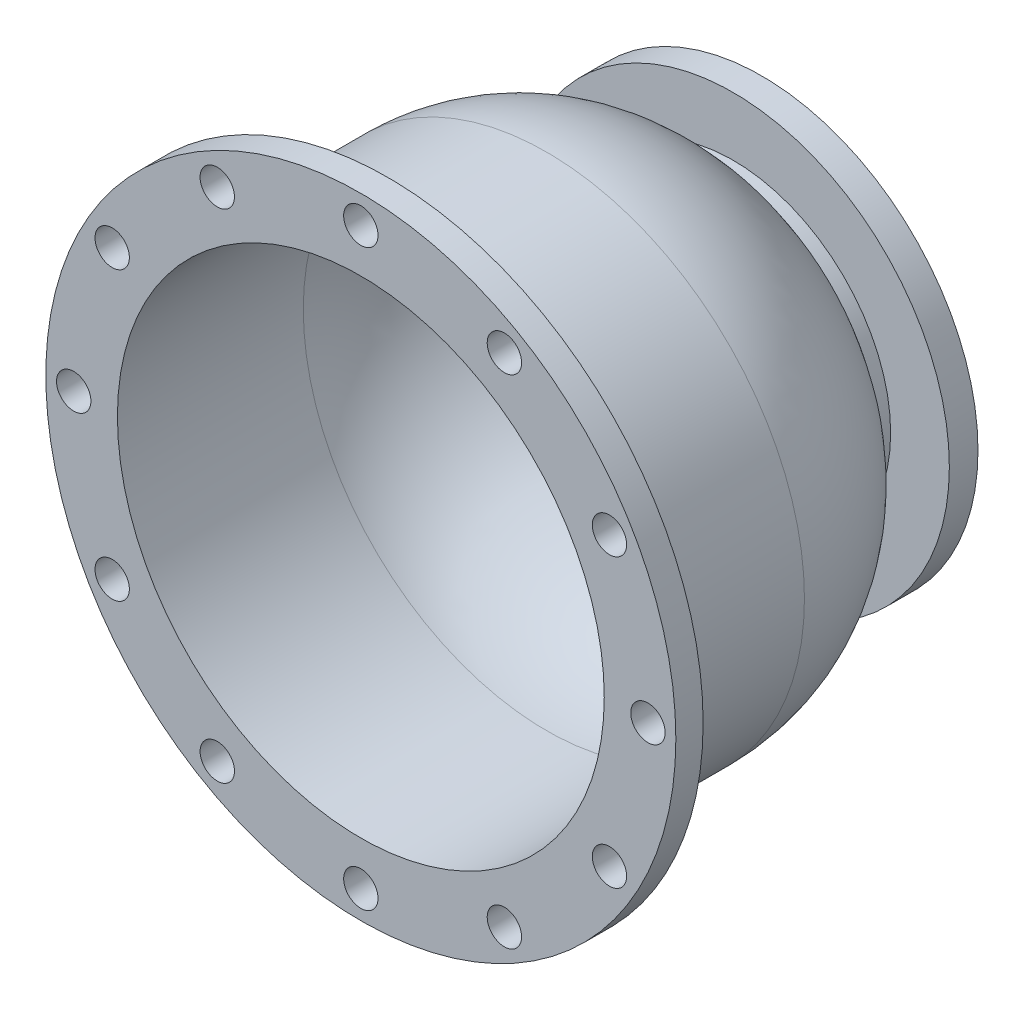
ISO-10303-21;
HEADER;
FILE_DESCRIPTION(('STEP AP214'),'2;1');
FILE_NAME('part.step','',(''),(''),'','','');
FILE_SCHEMA(('AUTOMOTIVE_DESIGN { 1 0 10303 214 1 1 1 1 }'));
ENDSEC;
DATA;
#1=APPLICATION_CONTEXT('core data for automotive mechanical design processes');
#2=APPLICATION_PROTOCOL_DEFINITION('international standard','automotive_design',2000,#1);
#3=PRODUCT_CONTEXT('',#1,'mechanical');
#4=PRODUCT('Part','Part','',(#3));
#5=PRODUCT_RELATED_PRODUCT_CATEGORY('part','',(#4));
#6=PRODUCT_DEFINITION_FORMATION('','',#4);
#7=PRODUCT_DEFINITION_CONTEXT('part definition',#1,'design');
#8=PRODUCT_DEFINITION('design','',#6,#7);
#9=PRODUCT_DEFINITION_SHAPE('','',#8);
#10=(LENGTH_UNIT() NAMED_UNIT(*) SI_UNIT(.MILLI.,.METRE.));
#11=(NAMED_UNIT(*) PLANE_ANGLE_UNIT() SI_UNIT($,.RADIAN.));
#12=(NAMED_UNIT(*) SI_UNIT($,.STERADIAN.) SOLID_ANGLE_UNIT());
#13=UNCERTAINTY_MEASURE_WITH_UNIT(LENGTH_MEASURE(1.E-05),#10,'distance_accuracy_value','');
#14=(GEOMETRIC_REPRESENTATION_CONTEXT(3) GLOBAL_UNCERTAINTY_ASSIGNED_CONTEXT((#13)) GLOBAL_UNIT_ASSIGNED_CONTEXT((#10,
#11,#12)) REPRESENTATION_CONTEXT('',''));
#15=CARTESIAN_POINT('',(0.,0.,0.));
#16=DIRECTION('',(0.,0.,1.));
#17=DIRECTION('',(1.,0.,0.));
#18=AXIS2_PLACEMENT_3D('',#15,#16,#17);
#19=CARTESIAN_POINT('',(0.,0.,0.));
#20=DIRECTION('',(0.,0.,1.));
#21=DIRECTION('',(1.,0.,0.));
#22=AXIS2_PLACEMENT_3D('',#19,#20,#21);
#23=CYLINDRICAL_SURFACE('',#22,220.);
#24=CARTESIAN_POINT('',(0.,0.,0.));
#25=DIRECTION('',(0.,0.,1.));
#26=DIRECTION('',(1.,0.,0.));
#27=AXIS2_PLACEMENT_3D('',#24,#25,#26);
#28=CIRCLE('',#27,220.);
#29=CARTESIAN_POINT('',(220.,0.,0.));
#30=VERTEX_POINT('',#29);
#31=EDGE_CURVE('E76',#30,#30,#28,.T.);
#32=ORIENTED_EDGE('',*,*,#31,.F.);
#33=EDGE_LOOP('',(#32));
#34=FACE_BOUND('',#33,.T.);
#35=CARTESIAN_POINT('',(0.,0.,-19.05));
#36=DIRECTION('',(0.,0.,1.));
#37=DIRECTION('',(1.,0.,0.));
#38=AXIS2_PLACEMENT_3D('',#35,#36,#37);
#39=CIRCLE('',#38,220.);
#40=CARTESIAN_POINT('',(220.,0.,-19.05));
#41=VERTEX_POINT('',#40);
#42=EDGE_CURVE('E10',#41,#41,#39,.T.);
#43=ORIENTED_EDGE('',*,*,#42,.T.);
#44=EDGE_LOOP('',(#43));
#45=FACE_BOUND('',#44,.T.);
#46=ADVANCED_FACE('F30',(#34,#45),#23,.T.);
#47=CARTESIAN_POINT('',(0.,220.,-19.05));
#48=DIRECTION('',(0.,0.,1.));
#49=DIRECTION('',(1.,0.,0.));
#50=AXIS2_PLACEMENT_3D('',#47,#48,#49);
#51=PLANE('',#50);
#52=CARTESIAN_POINT('',(-100.249999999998,-173.638093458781,-19.05));
#53=DIRECTION('',(0.,0.,-1.));
#54=DIRECTION('',(-1.,0.,0.));
#55=AXIS2_PLACEMENT_3D('',#52,#53,#54);
#56=CIRCLE('',#55,12.);
#57=CARTESIAN_POINT('',(-112.249999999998,-173.638093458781,-19.05));
#58=VERTEX_POINT('',#57);
#59=EDGE_CURVE('E148',#58,#58,#56,.T.);
#60=ORIENTED_EDGE('',*,*,#59,.F.);
#61=EDGE_LOOP('',(#60));
#62=FACE_BOUND('',#61,.T.);
#63=CARTESIAN_POINT('',(-173.638093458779,-100.250000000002,-19.05));
#64=DIRECTION('',(0.,0.,-1.));
#65=DIRECTION('',(-1.,0.,0.));
#66=AXIS2_PLACEMENT_3D('',#63,#64,#65);
#67=CIRCLE('',#66,12.);
#68=CARTESIAN_POINT('',(-185.638093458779,-100.250000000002,-19.05));
#69=VERTEX_POINT('',#68);
#70=EDGE_CURVE('E142',#69,#69,#67,.T.);
#71=ORIENTED_EDGE('',*,*,#70,.F.);
#72=EDGE_LOOP('',(#71));
#73=FACE_BOUND('',#72,.T.);
#74=CARTESIAN_POINT('',(-200.5,-2.10012602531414E-12,-19.05));
#75=DIRECTION('',(0.,0.,-1.));
#76=DIRECTION('',(-1.,0.,0.));
#77=AXIS2_PLACEMENT_3D('',#74,#75,#76);
#78=CIRCLE('',#77,12.);
#79=CARTESIAN_POINT('',(-212.5,-2.10012602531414E-12,-19.05));
#80=VERTEX_POINT('',#79);
#81=EDGE_CURVE('E136',#80,#80,#78,.T.);
#82=ORIENTED_EDGE('',*,*,#81,.F.);
#83=EDGE_LOOP('',(#82));
#84=FACE_BOUND('',#83,.T.);
#85=CARTESIAN_POINT('',(-173.638093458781,100.249999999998,-19.05));
#86=DIRECTION('',(0.,0.,-1.));
#87=DIRECTION('',(-1.,0.,0.));
#88=AXIS2_PLACEMENT_3D('',#85,#86,#87);
#89=CIRCLE('',#88,12.);
#90=CARTESIAN_POINT('',(-185.638093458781,100.249999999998,-19.05));
#91=VERTEX_POINT('',#90);
#92=EDGE_CURVE('E130',#91,#91,#89,.T.);
#93=ORIENTED_EDGE('',*,*,#92,.F.);
#94=EDGE_LOOP('',(#93));
#95=FACE_BOUND('',#94,.T.);
#96=CARTESIAN_POINT('',(-100.250000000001,173.638093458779,-19.05));
#97=DIRECTION('',(0.,0.,-1.));
#98=DIRECTION('',(-1.,0.,0.));
#99=AXIS2_PLACEMENT_3D('',#96,#97,#98);
#100=CIRCLE('',#99,12.);
#101=CARTESIAN_POINT('',(-112.250000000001,173.638093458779,-19.05));
#102=VERTEX_POINT('',#101);
#103=EDGE_CURVE('E124',#102,#102,#100,.T.);
#104=ORIENTED_EDGE('',*,*,#103,.F.);
#105=EDGE_LOOP('',(#104));
#106=FACE_BOUND('',#105,.T.);
#107=CARTESIAN_POINT('',(0.,200.5,-19.05));
#108=DIRECTION('',(0.,0.,-1.));
#109=DIRECTION('',(-1.,0.,0.));
#110=AXIS2_PLACEMENT_3D('',#107,#108,#109);
#111=CIRCLE('',#110,12.);
#112=CARTESIAN_POINT('',(-12.,200.5,-19.05));
#113=VERTEX_POINT('',#112);
#114=EDGE_CURVE('E118',#113,#113,#111,.T.);
#115=ORIENTED_EDGE('',*,*,#114,.F.);
#116=EDGE_LOOP('',(#115));
#117=FACE_BOUND('',#116,.T.);
#118=CARTESIAN_POINT('',(100.249999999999,173.638093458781,-19.05));
#119=DIRECTION('',(0.,0.,-1.));
#120=DIRECTION('',(-1.,0.,0.));
#121=AXIS2_PLACEMENT_3D('',#118,#119,#120);
#122=CIRCLE('',#121,12.);
#123=CARTESIAN_POINT('',(88.249999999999,173.638093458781,-19.05));
#124=VERTEX_POINT('',#123);
#125=EDGE_CURVE('E112',#124,#124,#122,.T.);
#126=ORIENTED_EDGE('',*,*,#125,.F.);
#127=EDGE_LOOP('',(#126));
#128=FACE_BOUND('',#127,.T.);
#129=CARTESIAN_POINT('',(173.63809345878,100.250000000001,-19.05));
#130=DIRECTION('',(0.,0.,-1.));
#131=DIRECTION('',(-1.,0.,0.));
#132=AXIS2_PLACEMENT_3D('',#129,#130,#131);
#133=CIRCLE('',#132,12.);
#134=CARTESIAN_POINT('',(161.63809345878,100.250000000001,-19.05));
#135=VERTEX_POINT('',#134);
#136=EDGE_CURVE('E106',#135,#135,#133,.T.);
#137=ORIENTED_EDGE('',*,*,#136,.F.);
#138=EDGE_LOOP('',(#137));
#139=FACE_BOUND('',#138,.T.);
#140=CARTESIAN_POINT('',(200.5,7.00042008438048E-13,-19.05));
#141=DIRECTION('',(0.,0.,-1.));
#142=DIRECTION('',(-1.,0.,0.));
#143=AXIS2_PLACEMENT_3D('',#140,#141,#142);
#144=CIRCLE('',#143,12.);
#145=CARTESIAN_POINT('',(188.5,7.00042008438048E-13,-19.05));
#146=VERTEX_POINT('',#145);
#147=EDGE_CURVE('E100',#146,#146,#144,.T.);
#148=ORIENTED_EDGE('',*,*,#147,.F.);
#149=EDGE_LOOP('',(#148));
#150=FACE_BOUND('',#149,.T.);
#151=CARTESIAN_POINT('',(173.63809345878,-100.25,-19.05));
#152=DIRECTION('',(0.,0.,-1.));
#153=DIRECTION('',(-1.,0.,0.));
#154=AXIS2_PLACEMENT_3D('',#151,#152,#153);
#155=CIRCLE('',#154,12.);
#156=CARTESIAN_POINT('',(161.63809345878,-100.25,-19.05));
#157=VERTEX_POINT('',#156);
#158=EDGE_CURVE('E94',#157,#157,#155,.T.);
#159=ORIENTED_EDGE('',*,*,#158,.F.);
#160=EDGE_LOOP('',(#159));
#161=FACE_BOUND('',#160,.T.);
#162=CARTESIAN_POINT('',(100.25,-173.63809345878,-19.05));
#163=DIRECTION('',(0.,0.,-1.));
#164=DIRECTION('',(-1.,0.,0.));
#165=AXIS2_PLACEMENT_3D('',#162,#163,#164);
#166=CIRCLE('',#165,12.);
#167=CARTESIAN_POINT('',(88.2500000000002,-173.63809345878,-19.05));
#168=VERTEX_POINT('',#167);
#169=EDGE_CURVE('E88',#168,#168,#166,.T.);
#170=ORIENTED_EDGE('',*,*,#169,.F.);
#171=EDGE_LOOP('',(#170));
#172=FACE_BOUND('',#171,.T.);
#173=CARTESIAN_POINT('',(0.,-200.5,-19.05));
#174=DIRECTION('',(0.,0.,-1.));
#175=DIRECTION('',(-1.,0.,0.));
#176=AXIS2_PLACEMENT_3D('',#173,#174,#175);
#177=CIRCLE('',#176,12.);
#178=CARTESIAN_POINT('',(-12.,-200.5,-19.05));
#179=VERTEX_POINT('',#178);
#180=EDGE_CURVE('E82',#179,#179,#177,.T.);
#181=ORIENTED_EDGE('',*,*,#180,.F.);
#182=EDGE_LOOP('',(#181));
#183=FACE_BOUND('',#182,.T.);
#184=ORIENTED_EDGE('',*,*,#42,.F.);
#185=EDGE_LOOP('',(#184));
#186=FACE_BOUND('',#185,.T.);
#187=CARTESIAN_POINT('',(0.,0.,-19.05));
#188=DIRECTION('',(0.,0.,1.));
#189=DIRECTION('',(1.,0.,0.));
#190=AXIS2_PLACEMENT_3D('',#187,#188,#189);
#191=CIRCLE('',#190,180.);
#192=CARTESIAN_POINT('',(180.,0.,-19.05));
#193=VERTEX_POINT('',#192);
#194=EDGE_CURVE('E36',#193,#193,#191,.T.);
#195=ORIENTED_EDGE('',*,*,#194,.T.);
#196=EDGE_LOOP('',(#195));
#197=FACE_BOUND('',#196,.T.);
#198=ADVANCED_FACE('F154',(#62,#73,#84,#95,#106,#117,#128,#139,#150,#161,#172,#183,#186,#197),
#51,.F.);
#199=CARTESIAN_POINT('',(0.,0.,0.));
#200=DIRECTION('',(0.,0.,1.));
#201=DIRECTION('',(1.,0.,0.));
#202=AXIS2_PLACEMENT_3D('',#199,#200,#201);
#203=CYLINDRICAL_SURFACE('',#202,180.);
#204=ORIENTED_EDGE('',*,*,#194,.F.);
#205=EDGE_LOOP('',(#204));
#206=FACE_BOUND('',#205,.T.);
#207=CARTESIAN_POINT('',(0.,0.,-129.8));
#208=DIRECTION('',(0.,0.,1.));
#209=DIRECTION('',(1.,0.,0.));
#210=AXIS2_PLACEMENT_3D('',#207,#208,#209);
#211=CIRCLE('',#210,180.);
#212=CARTESIAN_POINT('',(180.,0.,-129.8));
#213=VERTEX_POINT('',#212);
#214=EDGE_CURVE('E40',#213,#213,#211,.T.);
#215=ORIENTED_EDGE('',*,*,#214,.T.);
#216=EDGE_LOOP('',(#215));
#217=FACE_BOUND('',#216,.T.);
#218=ADVANCED_FACE('F157',(#206,#217),#203,.T.);
#219=CARTESIAN_POINT('',(0.,0.,-129.8));
#220=DIRECTION('',(0.,0.,1.));
#221=DIRECTION('',(1.,0.,0.));
#222=AXIS2_PLACEMENT_3D('',#219,#220,#221);
#223=DEGENERATE_TOROIDAL_SURFACE('',#222,42.1428571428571,137.857142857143,.T.);
#224=ORIENTED_EDGE('',*,*,#214,.F.);
#225=EDGE_LOOP('',(#224));
#226=FACE_BOUND('',#225,.T.);
#227=CARTESIAN_POINT('',(0.,0.,-249.8));
#228=DIRECTION('',(0.,0.,1.));
#229=DIRECTION('',(1.,0.,0.));
#230=AXIS2_PLACEMENT_3D('',#227,#228,#229);
#231=CIRCLE('',#230,110.);
#232=CARTESIAN_POINT('',(110.,0.,-249.8));
#233=VERTEX_POINT('',#232);
#234=EDGE_CURVE('E44',#233,#233,#231,.T.);
#235=ORIENTED_EDGE('',*,*,#234,.T.);
#236=EDGE_LOOP('',(#235));
#237=FACE_BOUND('',#236,.T.);
#238=ADVANCED_FACE('F215',(#226,#237),#223,.T.);
#239=CARTESIAN_POINT('',(0.,0.,0.));
#240=DIRECTION('',(0.,0.,1.));
#241=DIRECTION('',(1.,0.,0.));
#242=AXIS2_PLACEMENT_3D('',#239,#240,#241);
#243=CYLINDRICAL_SURFACE('',#242,110.);
#244=ORIENTED_EDGE('',*,*,#234,.F.);
#245=EDGE_LOOP('',(#244));
#246=FACE_BOUND('',#245,.T.);
#247=CARTESIAN_POINT('',(0.,0.,-260.));
#248=DIRECTION('',(0.,0.,1.));
#249=DIRECTION('',(1.,0.,0.));
#250=AXIS2_PLACEMENT_3D('',#247,#248,#249);
#251=CIRCLE('',#250,110.);
#252=CARTESIAN_POINT('',(110.,0.,-260.));
#253=VERTEX_POINT('',#252);
#254=EDGE_CURVE('E49',#253,#253,#251,.T.);
#255=ORIENTED_EDGE('',*,*,#254,.T.);
#256=EDGE_LOOP('',(#255));
#257=FACE_BOUND('',#256,.T.);
#258=ADVANCED_FACE('F223',(#246,#257),#243,.T.);
#259=CARTESIAN_POINT('',(0.,151.,-260.));
#260=DIRECTION('',(0.,0.,-1.));
#261=DIRECTION('',(-1.,0.,0.));
#262=AXIS2_PLACEMENT_3D('',#259,#260,#261);
#263=PLANE('',#262);
#264=ORIENTED_EDGE('',*,*,#254,.F.);
#265=EDGE_LOOP('',(#264));
#266=FACE_BOUND('',#265,.T.);
#267=CARTESIAN_POINT('',(0.,0.,-260.));
#268=DIRECTION('',(0.,0.,1.));
#269=DIRECTION('',(1.,0.,0.));
#270=AXIS2_PLACEMENT_3D('',#267,#268,#269);
#271=CIRCLE('',#270,151.);
#272=CARTESIAN_POINT('',(151.,0.,-260.));
#273=VERTEX_POINT('',#272);
#274=EDGE_CURVE('E52',#273,#273,#271,.T.);
#275=ORIENTED_EDGE('',*,*,#274,.T.);
#276=EDGE_LOOP('',(#275));
#277=FACE_BOUND('',#276,.T.);
#278=ADVANCED_FACE('F231',(#266,#277),#263,.F.);
#279=CARTESIAN_POINT('',(0.,0.,0.));
#280=DIRECTION('',(0.,0.,1.));
#281=DIRECTION('',(1.,0.,0.));
#282=AXIS2_PLACEMENT_3D('',#279,#280,#281);
#283=CYLINDRICAL_SURFACE('',#282,151.);
#284=ORIENTED_EDGE('',*,*,#274,.F.);
#285=EDGE_LOOP('',(#284));
#286=FACE_BOUND('',#285,.T.);
#287=CARTESIAN_POINT('',(0.,0.,-280.));
#288=DIRECTION('',(0.,0.,1.));
#289=DIRECTION('',(1.,0.,0.));
#290=AXIS2_PLACEMENT_3D('',#287,#288,#289);
#291=CIRCLE('',#290,151.);
#292=CARTESIAN_POINT('',(151.,0.,-280.));
#293=VERTEX_POINT('',#292);
#294=EDGE_CURVE('E55',#293,#293,#291,.T.);
#295=ORIENTED_EDGE('',*,*,#294,.T.);
#296=EDGE_LOOP('',(#295));
#297=FACE_BOUND('',#296,.T.);
#298=ADVANCED_FACE('F239',(#286,#297),#283,.T.);
#299=CARTESIAN_POINT('',(0.,110.,-280.));
#300=DIRECTION('',(0.,0.,1.));
#301=DIRECTION('',(1.,0.,0.));
#302=AXIS2_PLACEMENT_3D('',#299,#300,#301);
#303=PLANE('',#302);
#304=ORIENTED_EDGE('',*,*,#294,.F.);
#305=EDGE_LOOP('',(#304));
#306=FACE_BOUND('',#305,.T.);
#307=CARTESIAN_POINT('',(0.,0.,-280.));
#308=DIRECTION('',(0.,0.,1.));
#309=DIRECTION('',(1.,0.,0.));
#310=AXIS2_PLACEMENT_3D('',#307,#308,#309);
#311=CIRCLE('',#310,110.);
#312=CARTESIAN_POINT('',(110.,0.,-280.));
#313=VERTEX_POINT('',#312);
#314=EDGE_CURVE('E58',#313,#313,#311,.T.);
#315=ORIENTED_EDGE('',*,*,#314,.T.);
#316=EDGE_LOOP('',(#315));
#317=FACE_BOUND('',#316,.T.);
#318=ADVANCED_FACE('F247',(#306,#317),#303,.F.);
#319=CARTESIAN_POINT('',(0.,0.,0.));
#320=DIRECTION('',(0.,0.,1.));
#321=DIRECTION('',(1.,0.,0.));
#322=AXIS2_PLACEMENT_3D('',#319,#320,#321);
#323=CYLINDRICAL_SURFACE('',#322,110.);
#324=ORIENTED_EDGE('',*,*,#314,.F.);
#325=EDGE_LOOP('',(#324));
#326=FACE_BOUND('',#325,.T.);
#327=CARTESIAN_POINT('',(0.,0.,-304.));
#328=DIRECTION('',(0.,0.,1.));
#329=DIRECTION('',(1.,0.,0.));
#330=AXIS2_PLACEMENT_3D('',#327,#328,#329);
#331=CIRCLE('',#330,110.);
#332=CARTESIAN_POINT('',(110.,0.,-304.));
#333=VERTEX_POINT('',#332);
#334=EDGE_CURVE('E61',#333,#333,#331,.T.);
#335=ORIENTED_EDGE('',*,*,#334,.T.);
#336=EDGE_LOOP('',(#335));
#337=FACE_BOUND('',#336,.T.);
#338=ADVANCED_FACE('F255',(#326,#337),#323,.T.);
#339=CARTESIAN_POINT('',(0.,50.,-304.));
#340=DIRECTION('',(0.,0.,1.));
#341=DIRECTION('',(1.,0.,0.));
#342=AXIS2_PLACEMENT_3D('',#339,#340,#341);
#343=PLANE('',#342);
#344=ORIENTED_EDGE('',*,*,#334,.F.);
#345=EDGE_LOOP('',(#344));
#346=FACE_BOUND('',#345,.T.);
#347=CARTESIAN_POINT('',(0.,0.,-304.));
#348=DIRECTION('',(0.,0.,1.));
#349=DIRECTION('',(1.,0.,0.));
#350=AXIS2_PLACEMENT_3D('',#347,#348,#349);
#351=CIRCLE('',#350,50.);
#352=CARTESIAN_POINT('',(50.,0.,-304.));
#353=VERTEX_POINT('',#352);
#354=EDGE_CURVE('E64',#353,#353,#351,.T.);
#355=ORIENTED_EDGE('',*,*,#354,.T.);
#356=EDGE_LOOP('',(#355));
#357=FACE_BOUND('',#356,.T.);
#358=ADVANCED_FACE('F263',(#346,#357),#343,.F.);
#359=CARTESIAN_POINT('',(0.,0.,0.));
#360=DIRECTION('',(0.,0.,1.));
#361=DIRECTION('',(1.,0.,0.));
#362=AXIS2_PLACEMENT_3D('',#359,#360,#361);
#363=CYLINDRICAL_SURFACE('',#362,50.);
#364=ORIENTED_EDGE('',*,*,#354,.F.);
#365=EDGE_LOOP('',(#364));
#366=FACE_BOUND('',#365,.T.);
#367=CARTESIAN_POINT('',(0.,0.,-249.8));
#368=DIRECTION('',(0.,0.,1.));
#369=DIRECTION('',(1.,0.,0.));
#370=AXIS2_PLACEMENT_3D('',#367,#368,#369);
#371=CIRCLE('',#370,50.);
#372=CARTESIAN_POINT('',(50.,0.,-249.8));
#373=VERTEX_POINT('',#372);
#374=EDGE_CURVE('E67',#373,#373,#371,.T.);
#375=ORIENTED_EDGE('',*,*,#374,.T.);
#376=EDGE_LOOP('',(#375));
#377=FACE_BOUND('',#376,.T.);
#378=ADVANCED_FACE('F271',(#366,#377),#363,.F.);
#379=CARTESIAN_POINT('',(0.,0.,-129.8));
#380=DIRECTION('',(0.,0.,1.));
#381=DIRECTION('',(1.,0.,0.));
#382=AXIS2_PLACEMENT_3D('',#379,#380,#381);
#383=DEGENERATE_TOROIDAL_SURFACE('',#382,50.,120.,.T.);
#384=ORIENTED_EDGE('',*,*,#374,.F.);
#385=EDGE_LOOP('',(#384));
#386=FACE_BOUND('',#385,.T.);
#387=CARTESIAN_POINT('',(0.,0.,-129.8));
#388=DIRECTION('',(0.,0.,1.));
#389=DIRECTION('',(1.,0.,0.));
#390=AXIS2_PLACEMENT_3D('',#387,#388,#389);
#391=CIRCLE('',#390,170.);
#392=CARTESIAN_POINT('',(170.,0.,-129.8));
#393=VERTEX_POINT('',#392);
#394=EDGE_CURVE('E70',#393,#393,#391,.T.);
#395=ORIENTED_EDGE('',*,*,#394,.T.);
#396=EDGE_LOOP('',(#395));
#397=FACE_BOUND('',#396,.T.);
#398=ADVANCED_FACE('F279',(#386,#397),#383,.F.);
#399=CARTESIAN_POINT('',(0.,0.,0.));
#400=DIRECTION('',(0.,0.,1.));
#401=DIRECTION('',(1.,0.,0.));
#402=AXIS2_PLACEMENT_3D('',#399,#400,#401);
#403=CYLINDRICAL_SURFACE('',#402,170.);
#404=ORIENTED_EDGE('',*,*,#394,.F.);
#405=EDGE_LOOP('',(#404));
#406=FACE_BOUND('',#405,.T.);
#407=CARTESIAN_POINT('',(0.,0.,0.));
#408=DIRECTION('',(0.,0.,1.));
#409=DIRECTION('',(1.,0.,0.));
#410=AXIS2_PLACEMENT_3D('',#407,#408,#409);
#411=CIRCLE('',#410,170.);
#412=CARTESIAN_POINT('',(170.,0.,0.));
#413=VERTEX_POINT('',#412);
#414=EDGE_CURVE('E73',#413,#413,#411,.T.);
#415=ORIENTED_EDGE('',*,*,#414,.T.);
#416=EDGE_LOOP('',(#415));
#417=FACE_BOUND('',#416,.T.);
#418=ADVANCED_FACE('F194',(#406,#417),#403,.F.);
#419=CARTESIAN_POINT('',(0.,220.,0.));
#420=DIRECTION('',(0.,0.,-1.));
#421=DIRECTION('',(-1.,0.,0.));
#422=AXIS2_PLACEMENT_3D('',#419,#420,#421);
#423=PLANE('',#422);
#424=CARTESIAN_POINT('',(-100.249999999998,-173.638093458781,0.));
#425=DIRECTION('',(0.,0.,-1.));
#426=DIRECTION('',(-1.,0.,0.));
#427=AXIS2_PLACEMENT_3D('',#424,#425,#426);
#428=CIRCLE('',#427,12.);
#429=CARTESIAN_POINT('',(-112.249999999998,-173.638093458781,0.));
#430=VERTEX_POINT('',#429);
#431=EDGE_CURVE('E145',#430,#430,#428,.T.);
#432=ORIENTED_EDGE('',*,*,#431,.T.);
#433=EDGE_LOOP('',(#432));
#434=FACE_BOUND('',#433,.T.);
#435=CARTESIAN_POINT('',(-173.638093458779,-100.250000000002,0.));
#436=DIRECTION('',(0.,0.,-1.));
#437=DIRECTION('',(-1.,0.,0.));
#438=AXIS2_PLACEMENT_3D('',#435,#436,#437);
#439=CIRCLE('',#438,12.);
#440=CARTESIAN_POINT('',(-185.638093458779,-100.250000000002,0.));
#441=VERTEX_POINT('',#440);
#442=EDGE_CURVE('E139',#441,#441,#439,.T.);
#443=ORIENTED_EDGE('',*,*,#442,.T.);
#444=EDGE_LOOP('',(#443));
#445=FACE_BOUND('',#444,.T.);
#446=CARTESIAN_POINT('',(-200.5,-2.10012602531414E-12,0.));
#447=DIRECTION('',(0.,0.,-1.));
#448=DIRECTION('',(-1.,0.,0.));
#449=AXIS2_PLACEMENT_3D('',#446,#447,#448);
#450=CIRCLE('',#449,12.);
#451=CARTESIAN_POINT('',(-212.5,-2.10012602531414E-12,0.));
#452=VERTEX_POINT('',#451);
#453=EDGE_CURVE('E133',#452,#452,#450,.T.);
#454=ORIENTED_EDGE('',*,*,#453,.T.);
#455=EDGE_LOOP('',(#454));
#456=FACE_BOUND('',#455,.T.);
#457=CARTESIAN_POINT('',(-173.638093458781,100.249999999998,0.));
#458=DIRECTION('',(0.,0.,-1.));
#459=DIRECTION('',(-1.,0.,0.));
#460=AXIS2_PLACEMENT_3D('',#457,#458,#459);
#461=CIRCLE('',#460,12.);
#462=CARTESIAN_POINT('',(-185.638093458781,100.249999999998,0.));
#463=VERTEX_POINT('',#462);
#464=EDGE_CURVE('E127',#463,#463,#461,.T.);
#465=ORIENTED_EDGE('',*,*,#464,.T.);
#466=EDGE_LOOP('',(#465));
#467=FACE_BOUND('',#466,.T.);
#468=CARTESIAN_POINT('',(-100.250000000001,173.638093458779,0.));
#469=DIRECTION('',(0.,0.,-1.));
#470=DIRECTION('',(-1.,0.,0.));
#471=AXIS2_PLACEMENT_3D('',#468,#469,#470);
#472=CIRCLE('',#471,12.);
#473=CARTESIAN_POINT('',(-112.250000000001,173.638093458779,0.));
#474=VERTEX_POINT('',#473);
#475=EDGE_CURVE('E121',#474,#474,#472,.T.);
#476=ORIENTED_EDGE('',*,*,#475,.T.);
#477=EDGE_LOOP('',(#476));
#478=FACE_BOUND('',#477,.T.);
#479=CARTESIAN_POINT('',(0.,200.5,0.));
#480=DIRECTION('',(0.,0.,-1.));
#481=DIRECTION('',(-1.,0.,0.));
#482=AXIS2_PLACEMENT_3D('',#479,#480,#481);
#483=CIRCLE('',#482,12.);
#484=CARTESIAN_POINT('',(-12.,200.5,0.));
#485=VERTEX_POINT('',#484);
#486=EDGE_CURVE('E115',#485,#485,#483,.T.);
#487=ORIENTED_EDGE('',*,*,#486,.T.);
#488=EDGE_LOOP('',(#487));
#489=FACE_BOUND('',#488,.T.);
#490=CARTESIAN_POINT('',(100.249999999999,173.638093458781,0.));
#491=DIRECTION('',(0.,0.,-1.));
#492=DIRECTION('',(-1.,0.,0.));
#493=AXIS2_PLACEMENT_3D('',#490,#491,#492);
#494=CIRCLE('',#493,12.);
#495=CARTESIAN_POINT('',(88.249999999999,173.638093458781,0.));
#496=VERTEX_POINT('',#495);
#497=EDGE_CURVE('E109',#496,#496,#494,.T.);
#498=ORIENTED_EDGE('',*,*,#497,.T.);
#499=EDGE_LOOP('',(#498));
#500=FACE_BOUND('',#499,.T.);
#501=CARTESIAN_POINT('',(173.63809345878,100.250000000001,0.));
#502=DIRECTION('',(0.,0.,-1.));
#503=DIRECTION('',(-1.,0.,0.));
#504=AXIS2_PLACEMENT_3D('',#501,#502,#503);
#505=CIRCLE('',#504,12.);
#506=CARTESIAN_POINT('',(161.63809345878,100.250000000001,0.));
#507=VERTEX_POINT('',#506);
#508=EDGE_CURVE('E103',#507,#507,#505,.T.);
#509=ORIENTED_EDGE('',*,*,#508,.T.);
#510=EDGE_LOOP('',(#509));
#511=FACE_BOUND('',#510,.T.);
#512=CARTESIAN_POINT('',(200.5,7.00042008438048E-13,0.));
#513=DIRECTION('',(0.,0.,-1.));
#514=DIRECTION('',(-1.,0.,0.));
#515=AXIS2_PLACEMENT_3D('',#512,#513,#514);
#516=CIRCLE('',#515,12.);
#517=CARTESIAN_POINT('',(188.5,7.00042008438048E-13,0.));
#518=VERTEX_POINT('',#517);
#519=EDGE_CURVE('E97',#518,#518,#516,.T.);
#520=ORIENTED_EDGE('',*,*,#519,.T.);
#521=EDGE_LOOP('',(#520));
#522=FACE_BOUND('',#521,.T.);
#523=CARTESIAN_POINT('',(173.63809345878,-100.25,0.));
#524=DIRECTION('',(0.,0.,-1.));
#525=DIRECTION('',(-1.,0.,0.));
#526=AXIS2_PLACEMENT_3D('',#523,#524,#525);
#527=CIRCLE('',#526,12.);
#528=CARTESIAN_POINT('',(161.63809345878,-100.25,0.));
#529=VERTEX_POINT('',#528);
#530=EDGE_CURVE('E91',#529,#529,#527,.T.);
#531=ORIENTED_EDGE('',*,*,#530,.T.);
#532=EDGE_LOOP('',(#531));
#533=FACE_BOUND('',#532,.T.);
#534=CARTESIAN_POINT('',(100.25,-173.63809345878,0.));
#535=DIRECTION('',(0.,0.,-1.));
#536=DIRECTION('',(-1.,0.,0.));
#537=AXIS2_PLACEMENT_3D('',#534,#535,#536);
#538=CIRCLE('',#537,12.);
#539=CARTESIAN_POINT('',(88.2500000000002,-173.63809345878,0.));
#540=VERTEX_POINT('',#539);
#541=EDGE_CURVE('E85',#540,#540,#538,.T.);
#542=ORIENTED_EDGE('',*,*,#541,.T.);
#543=EDGE_LOOP('',(#542));
#544=FACE_BOUND('',#543,.T.);
#545=CARTESIAN_POINT('',(0.,-200.5,0.));
#546=DIRECTION('',(0.,0.,-1.));
#547=DIRECTION('',(-1.,0.,0.));
#548=AXIS2_PLACEMENT_3D('',#545,#546,#547);
#549=CIRCLE('',#548,12.);
#550=CARTESIAN_POINT('',(-12.,-200.5,0.));
#551=VERTEX_POINT('',#550);
#552=EDGE_CURVE('E79',#551,#551,#549,.T.);
#553=ORIENTED_EDGE('',*,*,#552,.T.);
#554=EDGE_LOOP('',(#553));
#555=FACE_BOUND('',#554,.T.);
#556=ORIENTED_EDGE('',*,*,#414,.F.);
#557=EDGE_LOOP('',(#556));
#558=FACE_BOUND('',#557,.T.);
#559=ORIENTED_EDGE('',*,*,#31,.T.);
#560=EDGE_LOOP('',(#559));
#561=FACE_BOUND('',#560,.T.);
#562=ADVANCED_FACE('F184',(#434,#445,#456,#467,#478,#489,#500,#511,#522,#533,#544,#555,#558,
#561),#423,.F.);
#563=CARTESIAN_POINT('',(0.,-200.5,-19.05));
#564=DIRECTION('',(0.,0.,-1.));
#565=DIRECTION('',(-1.,0.,0.));
#566=AXIS2_PLACEMENT_3D('',#563,#564,#565);
#567=CYLINDRICAL_SURFACE('',#566,12.);
#568=ORIENTED_EDGE('',*,*,#552,.F.);
#569=EDGE_LOOP('',(#568));
#570=FACE_BOUND('',#569,.T.);
#571=ORIENTED_EDGE('',*,*,#180,.T.);
#572=EDGE_LOOP('',(#571));
#573=FACE_BOUND('',#572,.T.);
#574=ADVANCED_FACE('F181',(#570,#573),#567,.F.);
#575=CARTESIAN_POINT('',(100.25,-173.63809345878,-19.05));
#576=DIRECTION('',(0.,0.,-1.));
#577=DIRECTION('',(-1.,0.,0.));
#578=AXIS2_PLACEMENT_3D('',#575,#576,#577);
#579=CYLINDRICAL_SURFACE('',#578,12.);
#580=ORIENTED_EDGE('',*,*,#541,.F.);
#581=EDGE_LOOP('',(#580));
#582=FACE_BOUND('',#581,.T.);
#583=ORIENTED_EDGE('',*,*,#169,.T.);
#584=EDGE_LOOP('',(#583));
#585=FACE_BOUND('',#584,.T.);
#586=ADVANCED_FACE('F183',(#582,#585),#579,.F.);
#587=CARTESIAN_POINT('',(173.63809345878,-100.25,-19.05));
#588=DIRECTION('',(0.,0.,-1.));
#589=DIRECTION('',(-1.,0.,0.));
#590=AXIS2_PLACEMENT_3D('',#587,#588,#589);
#591=CYLINDRICAL_SURFACE('',#590,12.);
#592=ORIENTED_EDGE('',*,*,#530,.F.);
#593=EDGE_LOOP('',(#592));
#594=FACE_BOUND('',#593,.T.);
#595=ORIENTED_EDGE('',*,*,#158,.T.);
#596=EDGE_LOOP('',(#595));
#597=FACE_BOUND('',#596,.T.);
#598=ADVANCED_FACE('F191',(#594,#597),#591,.F.);
#599=CARTESIAN_POINT('',(200.5,7.00042008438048E-13,-19.05));
#600=DIRECTION('',(0.,0.,-1.));
#601=DIRECTION('',(-1.,0.,0.));
#602=AXIS2_PLACEMENT_3D('',#599,#600,#601);
#603=CYLINDRICAL_SURFACE('',#602,12.);
#604=ORIENTED_EDGE('',*,*,#519,.F.);
#605=EDGE_LOOP('',(#604));
#606=FACE_BOUND('',#605,.T.);
#607=ORIENTED_EDGE('',*,*,#147,.T.);
#608=EDGE_LOOP('',(#607));
#609=FACE_BOUND('',#608,.T.);
#610=ADVANCED_FACE('F314',(#606,#609),#603,.F.);
#611=CARTESIAN_POINT('',(173.63809345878,100.250000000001,-19.05));
#612=DIRECTION('',(0.,0.,-1.));
#613=DIRECTION('',(-1.,0.,0.));
#614=AXIS2_PLACEMENT_3D('',#611,#612,#613);
#615=CYLINDRICAL_SURFACE('',#614,12.);
#616=ORIENTED_EDGE('',*,*,#508,.F.);
#617=EDGE_LOOP('',(#616));
#618=FACE_BOUND('',#617,.T.);
#619=ORIENTED_EDGE('',*,*,#136,.T.);
#620=EDGE_LOOP('',(#619));
#621=FACE_BOUND('',#620,.T.);
#622=ADVANCED_FACE('F324',(#618,#621),#615,.F.);
#623=CARTESIAN_POINT('',(100.249999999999,173.638093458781,-19.05));
#624=DIRECTION('',(0.,0.,-1.));
#625=DIRECTION('',(-1.,0.,0.));
#626=AXIS2_PLACEMENT_3D('',#623,#624,#625);
#627=CYLINDRICAL_SURFACE('',#626,12.);
#628=ORIENTED_EDGE('',*,*,#497,.F.);
#629=EDGE_LOOP('',(#628));
#630=FACE_BOUND('',#629,.T.);
#631=ORIENTED_EDGE('',*,*,#125,.T.);
#632=EDGE_LOOP('',(#631));
#633=FACE_BOUND('',#632,.T.);
#634=ADVANCED_FACE('F334',(#630,#633),#627,.F.);
#635=CARTESIAN_POINT('',(0.,200.5,-19.05));
#636=DIRECTION('',(0.,0.,-1.));
#637=DIRECTION('',(-1.,0.,0.));
#638=AXIS2_PLACEMENT_3D('',#635,#636,#637);
#639=CYLINDRICAL_SURFACE('',#638,12.);
#640=ORIENTED_EDGE('',*,*,#486,.F.);
#641=EDGE_LOOP('',(#640));
#642=FACE_BOUND('',#641,.T.);
#643=ORIENTED_EDGE('',*,*,#114,.T.);
#644=EDGE_LOOP('',(#643));
#645=FACE_BOUND('',#644,.T.);
#646=ADVANCED_FACE('F344',(#642,#645),#639,.F.);
#647=CARTESIAN_POINT('',(-100.250000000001,173.638093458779,-19.05));
#648=DIRECTION('',(0.,0.,-1.));
#649=DIRECTION('',(-1.,0.,0.));
#650=AXIS2_PLACEMENT_3D('',#647,#648,#649);
#651=CYLINDRICAL_SURFACE('',#650,12.);
#652=ORIENTED_EDGE('',*,*,#475,.F.);
#653=EDGE_LOOP('',(#652));
#654=FACE_BOUND('',#653,.T.);
#655=ORIENTED_EDGE('',*,*,#103,.T.);
#656=EDGE_LOOP('',(#655));
#657=FACE_BOUND('',#656,.T.);
#658=ADVANCED_FACE('F354',(#654,#657),#651,.F.);
#659=CARTESIAN_POINT('',(-173.638093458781,100.249999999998,-19.05));
#660=DIRECTION('',(0.,0.,-1.));
#661=DIRECTION('',(-1.,0.,0.));
#662=AXIS2_PLACEMENT_3D('',#659,#660,#661);
#663=CYLINDRICAL_SURFACE('',#662,12.);
#664=ORIENTED_EDGE('',*,*,#464,.F.);
#665=EDGE_LOOP('',(#664));
#666=FACE_BOUND('',#665,.T.);
#667=ORIENTED_EDGE('',*,*,#92,.T.);
#668=EDGE_LOOP('',(#667));
#669=FACE_BOUND('',#668,.T.);
#670=ADVANCED_FACE('F364',(#666,#669),#663,.F.);
#671=CARTESIAN_POINT('',(-200.5,-2.10012602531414E-12,-19.05));
#672=DIRECTION('',(0.,0.,-1.));
#673=DIRECTION('',(-1.,0.,0.));
#674=AXIS2_PLACEMENT_3D('',#671,#672,#673);
#675=CYLINDRICAL_SURFACE('',#674,12.);
#676=ORIENTED_EDGE('',*,*,#453,.F.);
#677=EDGE_LOOP('',(#676));
#678=FACE_BOUND('',#677,.T.);
#679=ORIENTED_EDGE('',*,*,#81,.T.);
#680=EDGE_LOOP('',(#679));
#681=FACE_BOUND('',#680,.T.);
#682=ADVANCED_FACE('F374',(#678,#681),#675,.F.);
#683=CARTESIAN_POINT('',(-173.638093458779,-100.250000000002,-19.05));
#684=DIRECTION('',(0.,0.,-1.));
#685=DIRECTION('',(-1.,0.,0.));
#686=AXIS2_PLACEMENT_3D('',#683,#684,#685);
#687=CYLINDRICAL_SURFACE('',#686,12.);
#688=ORIENTED_EDGE('',*,*,#442,.F.);
#689=EDGE_LOOP('',(#688));
#690=FACE_BOUND('',#689,.T.);
#691=ORIENTED_EDGE('',*,*,#70,.T.);
#692=EDGE_LOOP('',(#691));
#693=FACE_BOUND('',#692,.T.);
#694=ADVANCED_FACE('F384',(#690,#693),#687,.F.);
#695=CARTESIAN_POINT('',(-100.249999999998,-173.638093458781,-19.05));
#696=DIRECTION('',(0.,0.,-1.));
#697=DIRECTION('',(-1.,0.,0.));
#698=AXIS2_PLACEMENT_3D('',#695,#696,#697);
#699=CYLINDRICAL_SURFACE('',#698,12.);
#700=ORIENTED_EDGE('',*,*,#431,.F.);
#701=EDGE_LOOP('',(#700));
#702=FACE_BOUND('',#701,.T.);
#703=ORIENTED_EDGE('',*,*,#59,.T.);
#704=EDGE_LOOP('',(#703));
#705=FACE_BOUND('',#704,.T.);
#706=ADVANCED_FACE('F152',(#702,#705),#699,.F.);
#707=CLOSED_SHELL('',(#46,#198,#218,#238,#258,#278,#298,#318,#338,#358,#378,#398,#418,#562,#574,
#586,#598,#610,#622,#634,#646,#658,#670,#682,#694,#706));
#708=MANIFOLD_SOLID_BREP('B2',#707);
#709=ADVANCED_BREP_SHAPE_REPRESENTATION('',(#18,#708),#14);
#710=SHAPE_DEFINITION_REPRESENTATION(#9,#709);
ENDSEC;
END-ISO-10303-21;
